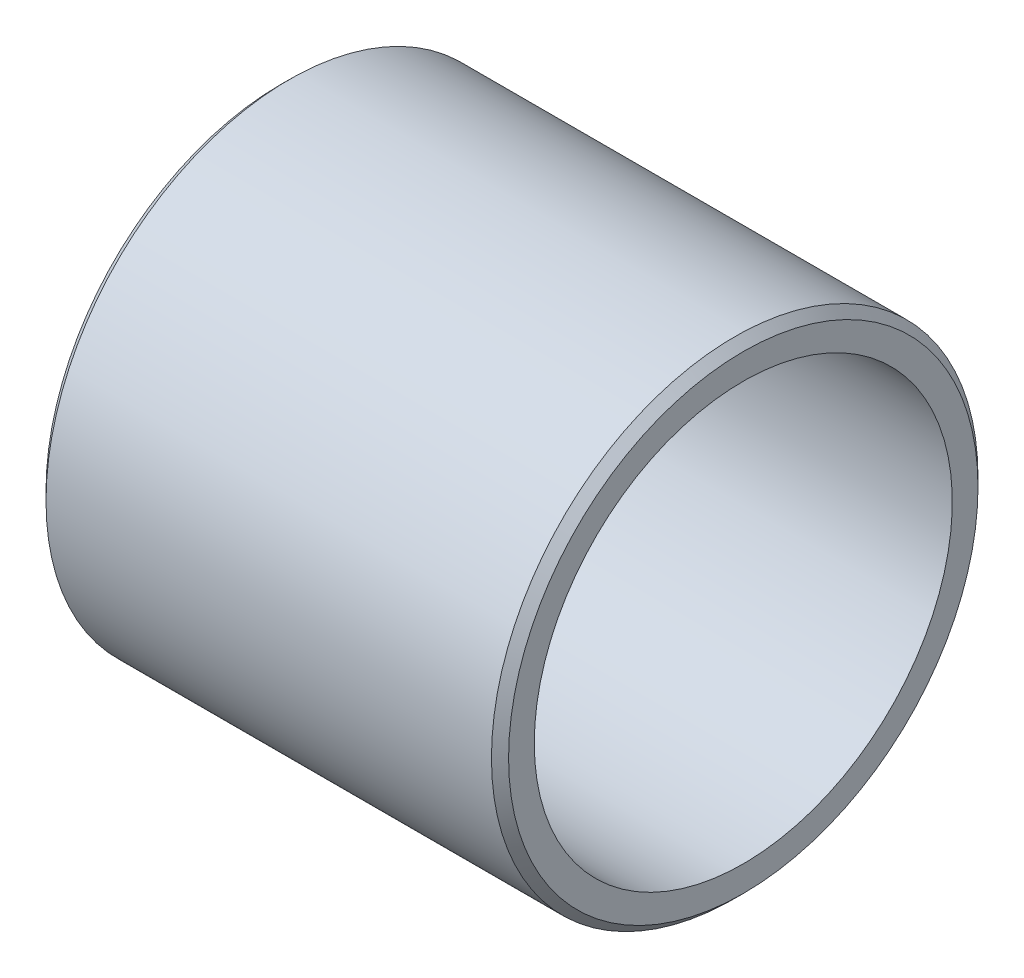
from build123d import *

# Parameters (mm, degrees)
ESQUISSE1_W     = 27
ESQUISSE1_H     = 2
CHANFREIN1_SIZE = 0.5


with BuildPart() as part:
    # Esquisse1 → Base-R_vol.-Mince (revolve)
    with BuildSketch(Plane.XY, mode=Mode.PRIVATE) as base_r_vol_mince_sk:
        with Locations((0, 13.2)):
            Rectangle(ESQUISSE1_W, ESQUISSE1_H)
    revolve(base_r_vol_mince_sk.sketch.rotate(Axis((0, 0, 0), (1, 0, 0)), 90), axis=Axis((0, 0, 0), (1, 0, 0)))

    # Chanfrein1
    chanfrein1_edges = [part.edges().sort_by_distance(p)[0] for p in [
        (-13.5, 0, -14.2),
        (13.5, 0, -14.2),
    ]]
    chamfer(chanfrein1_edges, length=CHANFREIN1_SIZE)


solid = part.part
